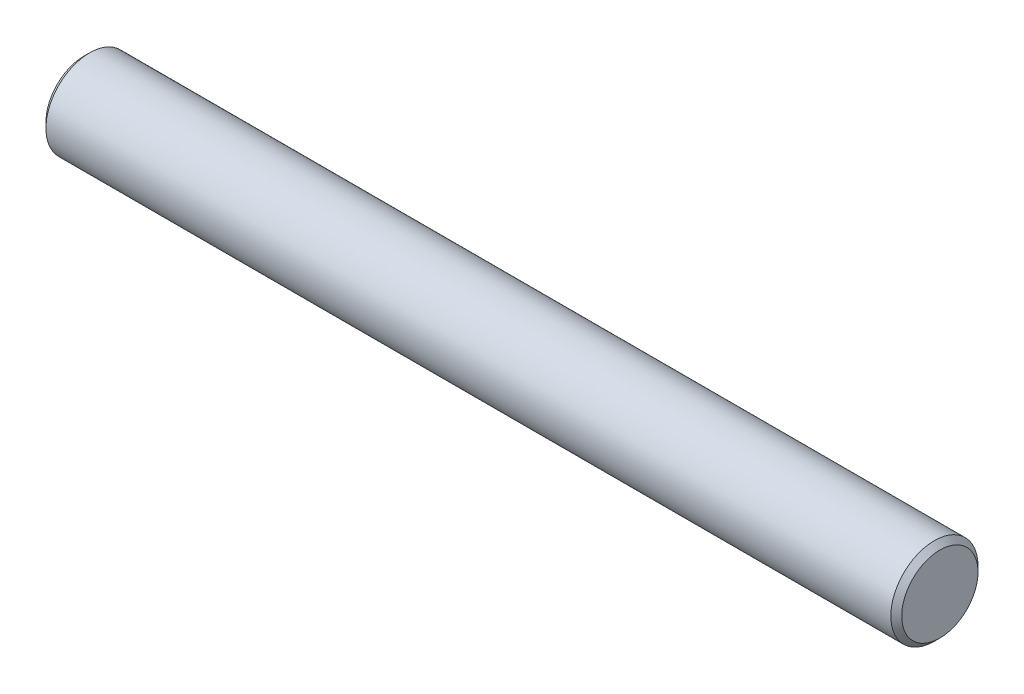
ISO-10303-21;
HEADER;
FILE_DESCRIPTION(('STEP AP214'),'2;1');
FILE_NAME('part.step','',(''),(''),'','','');
FILE_SCHEMA(('AUTOMOTIVE_DESIGN { 1 0 10303 214 1 1 1 1 }'));
ENDSEC;
DATA;
#1=APPLICATION_CONTEXT('core data for automotive mechanical design processes');
#2=APPLICATION_PROTOCOL_DEFINITION('international standard','automotive_design',2000,#1);
#3=PRODUCT_CONTEXT('',#1,'mechanical');
#4=PRODUCT('Part','Part','',(#3));
#5=PRODUCT_RELATED_PRODUCT_CATEGORY('part','',(#4));
#6=PRODUCT_DEFINITION_FORMATION('','',#4);
#7=PRODUCT_DEFINITION_CONTEXT('part definition',#1,'design');
#8=PRODUCT_DEFINITION('design','',#6,#7);
#9=PRODUCT_DEFINITION_SHAPE('','',#8);
#10=(LENGTH_UNIT() NAMED_UNIT(*) SI_UNIT(.MILLI.,.METRE.));
#11=(NAMED_UNIT(*) PLANE_ANGLE_UNIT() SI_UNIT($,.RADIAN.));
#12=(NAMED_UNIT(*) SI_UNIT($,.STERADIAN.) SOLID_ANGLE_UNIT());
#13=UNCERTAINTY_MEASURE_WITH_UNIT(LENGTH_MEASURE(1.E-05),#10,'distance_accuracy_value','');
#14=(GEOMETRIC_REPRESENTATION_CONTEXT(3) GLOBAL_UNCERTAINTY_ASSIGNED_CONTEXT((#13)) GLOBAL_UNIT_ASSIGNED_CONTEXT((#10,
#11,#12)) REPRESENTATION_CONTEXT('',''));
#15=CARTESIAN_POINT('',(0.,0.,0.));
#16=DIRECTION('',(0.,0.,1.));
#17=DIRECTION('',(1.,0.,0.));
#18=AXIS2_PLACEMENT_3D('',#15,#16,#17);
#19=CARTESIAN_POINT('',(157.,0.,0.));
#20=DIRECTION('',(-1.,0.,0.));
#21=DIRECTION('',(0.,0.,1.));
#22=AXIS2_PLACEMENT_3D('',#19,#20,#21);
#23=CYLINDRICAL_SURFACE('',#22,8.);
#24=CARTESIAN_POINT('',(156.,0.,0.));
#25=DIRECTION('',(1.,0.,0.));
#26=DIRECTION('',(0.,0.,-1.));
#27=AXIS2_PLACEMENT_3D('',#24,#25,#26);
#28=CIRCLE('',#27,8.);
#29=CARTESIAN_POINT('',(156.,0.,-8.));
#30=VERTEX_POINT('',#29);
#31=EDGE_CURVE('E9178',#30,#30,#28,.F.);
#32=ORIENTED_EDGE('',*,*,#31,.T.);
#33=EDGE_LOOP('',(#32));
#34=FACE_BOUND('',#33,.T.);
#35=CARTESIAN_POINT('',(1.,0.,0.));
#36=DIRECTION('',(1.,0.,0.));
#37=DIRECTION('',(0.,0.,-1.));
#38=AXIS2_PLACEMENT_3D('',#35,#36,#37);
#39=CIRCLE('',#38,8.);
#40=CARTESIAN_POINT('',(1.,0.,-8.));
#41=VERTEX_POINT('',#40);
#42=EDGE_CURVE('E9182',#41,#41,#39,.T.);
#43=ORIENTED_EDGE('',*,*,#42,.T.);
#44=EDGE_LOOP('',(#43));
#45=FACE_BOUND('',#44,.T.);
#46=ADVANCED_FACE('F9172',(#34,#45),#23,.T.);
#47=CARTESIAN_POINT('',(157.,0.,0.));
#48=DIRECTION('',(1.,0.,0.));
#49=DIRECTION('',(0.,0.,-1.));
#50=AXIS2_PLACEMENT_3D('',#47,#48,#49);
#51=PLANE('',#50);
#52=CARTESIAN_POINT('',(157.,0.,0.));
#53=DIRECTION('',(1.,0.,0.));
#54=DIRECTION('',(0.,0.,-1.));
#55=AXIS2_PLACEMENT_3D('',#52,#53,#54);
#56=CIRCLE('',#55,7.);
#57=CARTESIAN_POINT('',(157.,0.,-7.));
#58=VERTEX_POINT('',#57);
#59=EDGE_CURVE('E9186',#58,#58,#56,.T.);
#60=ORIENTED_EDGE('',*,*,#59,.T.);
#61=EDGE_LOOP('',(#60));
#62=FACE_BOUND('',#61,.T.);
#63=ADVANCED_FACE('F9192',(#62),#51,.T.);
#64=CARTESIAN_POINT('',(0.,0.,0.));
#65=DIRECTION('',(1.,0.,0.));
#66=DIRECTION('',(0.,0.,-1.));
#67=AXIS2_PLACEMENT_3D('',#64,#65,#66);
#68=PLANE('',#67);
#69=CARTESIAN_POINT('',(0.,0.,0.));
#70=DIRECTION('',(1.,0.,0.));
#71=DIRECTION('',(0.,0.,-1.));
#72=AXIS2_PLACEMENT_3D('',#69,#70,#71);
#73=CIRCLE('',#72,7.);
#74=CARTESIAN_POINT('',(0.,0.,-7.));
#75=VERTEX_POINT('',#74);
#76=EDGE_CURVE('E10',#75,#75,#73,.F.);
#77=ORIENTED_EDGE('',*,*,#76,.T.);
#78=EDGE_LOOP('',(#77));
#79=FACE_BOUND('',#78,.T.);
#80=ADVANCED_FACE('F9197',(#79),#68,.F.);
#81=CARTESIAN_POINT('',(157.,0.,0.));
#82=DIRECTION('',(-1.,0.,0.));
#83=DIRECTION('',(0.,0.,1.));
#84=AXIS2_PLACEMENT_3D('',#81,#82,#83);
#85=CONICAL_SURFACE('',#84,7.,0.785398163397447);
#86=ORIENTED_EDGE('',*,*,#31,.F.);
#87=EDGE_LOOP('',(#86));
#88=FACE_BOUND('',#87,.T.);
#89=ORIENTED_EDGE('',*,*,#59,.F.);
#90=EDGE_LOOP('',(#89));
#91=FACE_BOUND('',#90,.T.);
#92=ADVANCED_FACE('F9194',(#88,#91),#85,.T.);
#93=CARTESIAN_POINT('',(1.,0.,0.));
#94=DIRECTION('',(1.,0.,0.));
#95=DIRECTION('',(0.,0.,-1.));
#96=AXIS2_PLACEMENT_3D('',#93,#94,#95);
#97=CONICAL_SURFACE('',#96,8.,0.785398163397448);
#98=ORIENTED_EDGE('',*,*,#76,.F.);
#99=EDGE_LOOP('',(#98));
#100=FACE_BOUND('',#99,.T.);
#101=ORIENTED_EDGE('',*,*,#42,.F.);
#102=EDGE_LOOP('',(#101));
#103=FACE_BOUND('',#102,.T.);
#104=ADVANCED_FACE('F9196',(#100,#103),#97,.T.);
#105=CLOSED_SHELL('',(#46,#63,#80,#92,#104));
#106=MANIFOLD_SOLID_BREP('B2',#105);
#107=ADVANCED_BREP_SHAPE_REPRESENTATION('',(#18,#106),#14);
#108=SHAPE_DEFINITION_REPRESENTATION(#9,#107);
ENDSEC;
END-ISO-10303-21;
